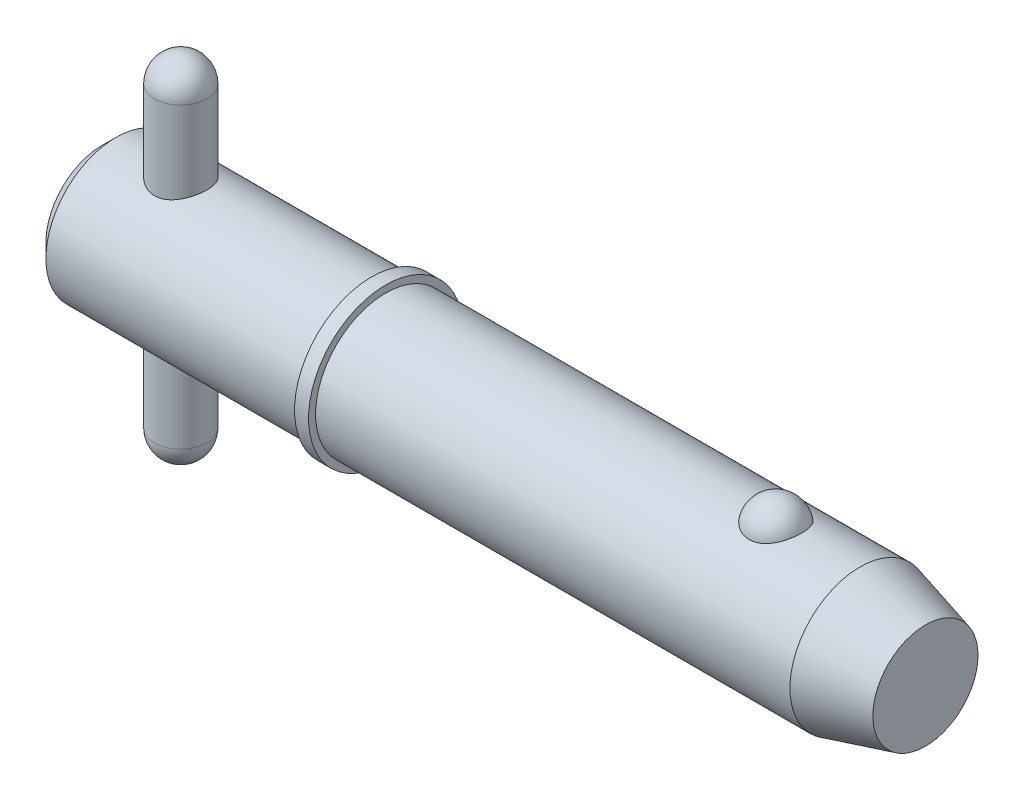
ISO-10303-21;
HEADER;
FILE_DESCRIPTION(('STEP AP214'),'2;1');
FILE_NAME('part.step','',(''),(''),'','','');
FILE_SCHEMA(('AUTOMOTIVE_DESIGN { 1 0 10303 214 1 1 1 1 }'));
ENDSEC;
DATA;
#1=APPLICATION_CONTEXT('core data for automotive mechanical design processes');
#2=APPLICATION_PROTOCOL_DEFINITION('international standard','automotive_design',2000,#1);
#3=PRODUCT_CONTEXT('',#1,'mechanical');
#4=PRODUCT('Part','Part','',(#3));
#5=PRODUCT_RELATED_PRODUCT_CATEGORY('part','',(#4));
#6=PRODUCT_DEFINITION_FORMATION('','',#4);
#7=PRODUCT_DEFINITION_CONTEXT('part definition',#1,'design');
#8=PRODUCT_DEFINITION('design','',#6,#7);
#9=PRODUCT_DEFINITION_SHAPE('','',#8);
#10=(LENGTH_UNIT() NAMED_UNIT(*) SI_UNIT(.MILLI.,.METRE.));
#11=(NAMED_UNIT(*) PLANE_ANGLE_UNIT() SI_UNIT($,.RADIAN.));
#12=(NAMED_UNIT(*) SI_UNIT($,.STERADIAN.) SOLID_ANGLE_UNIT());
#13=UNCERTAINTY_MEASURE_WITH_UNIT(LENGTH_MEASURE(1.E-05),#10,'distance_accuracy_value','');
#14=(GEOMETRIC_REPRESENTATION_CONTEXT(3) GLOBAL_UNCERTAINTY_ASSIGNED_CONTEXT((#13)) GLOBAL_UNIT_ASSIGNED_CONTEXT((#10,
#11,#12)) REPRESENTATION_CONTEXT('',''));
#15=CARTESIAN_POINT('',(0.,0.,0.));
#16=DIRECTION('',(0.,0.,1.));
#17=DIRECTION('',(1.,0.,0.));
#18=AXIS2_PLACEMENT_3D('',#15,#16,#17);
#19=CARTESIAN_POINT('',(7.14,15.875,0.));
#20=DIRECTION('',(0.,-1.,0.));
#21=DIRECTION('',(0.,0.,-1.));
#22=AXIS2_PLACEMENT_3D('',#19,#20,#21);
#23=CYLINDRICAL_SURFACE('',#22,2.38);
#24=CARTESIAN_POINT('',(7.14,-13.495,0.));
#25=DIRECTION('',(0.,-1.,0.));
#26=DIRECTION('',(0.,0.,-1.));
#27=AXIS2_PLACEMENT_3D('',#24,#25,#26);
#28=CIRCLE('',#27,2.38);
#29=CARTESIAN_POINT('',(7.14,-13.495,-2.38));
#30=VERTEX_POINT('',#29);
#31=EDGE_CURVE('P0_E10',#30,#30,#28,.F.);
#32=ORIENTED_EDGE('',*,*,#31,.T.);
#33=EDGE_LOOP('',(#32));
#34=FACE_BOUND('',#33,.T.);
#35=CARTESIAN_POINT('',(7.14,13.495,0.));
#36=DIRECTION('',(0.,-1.,0.));
#37=DIRECTION('',(0.,0.,-1.));
#38=AXIS2_PLACEMENT_3D('',#35,#36,#37);
#39=CIRCLE('',#38,2.38);
#40=CARTESIAN_POINT('',(7.14,13.495,-2.38));
#41=VERTEX_POINT('',#40);
#42=EDGE_CURVE('P0_E21',#41,#41,#39,.T.);
#43=ORIENTED_EDGE('',*,*,#42,.T.);
#44=EDGE_LOOP('',(#43));
#45=FACE_BOUND('',#44,.T.);
#46=ADVANCED_FACE('P0_F14',(#34,#45),#23,.T.);
#47=CARTESIAN_POINT('',(7.14,-13.495,0.));
#48=DIRECTION('',(0.,0.,1.));
#49=DIRECTION('',(1.,0.,0.));
#50=AXIS2_PLACEMENT_3D('',#47,#48,#49);
#51=SPHERICAL_SURFACE('',#50,2.38);
#52=CARTESIAN_POINT('',(7.14,-13.495,0.));
#53=DIRECTION('',(0.,-1.,0.));
#54=DIRECTION('',(0.,0.,-1.));
#55=AXIS2_PLACEMENT_3D('',#52,#53,#54);
#56=SPHERICAL_SURFACE('',#55,2.38);
#57=ORIENTED_EDGE('',*,*,#31,.F.);
#58=EDGE_LOOP('',(#57));
#59=FACE_BOUND('',#58,.T.);
#60=ADVANCED_FACE('P0_F29',(#59),#56,.T.);
#61=CARTESIAN_POINT('',(7.14,13.495,0.));
#62=DIRECTION('',(0.,0.,1.));
#63=DIRECTION('',(1.,0.,0.));
#64=AXIS2_PLACEMENT_3D('',#61,#62,#63);
#65=SPHERICAL_SURFACE('',#64,2.38);
#66=CARTESIAN_POINT('',(7.14,13.495,0.));
#67=DIRECTION('',(0.,-1.,0.));
#68=DIRECTION('',(0.,0.,-1.));
#69=AXIS2_PLACEMENT_3D('',#66,#67,#68);
#70=SPHERICAL_SURFACE('',#69,2.38);
#71=ORIENTED_EDGE('',*,*,#42,.F.);
#72=EDGE_LOOP('',(#71));
#73=FACE_BOUND('',#72,.T.);
#74=ADVANCED_FACE('P0_F16',(#73),#70,.T.);
#75=CLOSED_SHELL('',(#46,#60,#74));
#76=MANIFOLD_SOLID_BREP('P0_B1',#75);
#77=CARTESIAN_POINT('',(0.,0.,0.));
#78=DIRECTION('',(1.,0.,0.));
#79=DIRECTION('',(0.,0.,-1.));
#80=AXIS2_PLACEMENT_3D('',#77,#78,#79);
#81=CYLINDRICAL_SURFACE('',#80,6.35);
#82=CARTESIAN_POINT('',(68.6753693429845,0.,0.));
#83=DIRECTION('',(1.,0.,0.));
#84=DIRECTION('',(0.,0.,-1.));
#85=AXIS2_PLACEMENT_3D('',#82,#83,#84);
#86=CIRCLE('',#85,6.35);
#87=CARTESIAN_POINT('',(68.6753693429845,0.,-6.35));
#88=VERTEX_POINT('',#87);
#89=EDGE_CURVE('P1_E81',#88,#88,#86,.T.);
#90=ORIENTED_EDGE('',*,*,#89,.F.);
#91=EDGE_LOOP('',(#90));
#92=FACE_BOUND('',#91,.T.);
#93=CARTESIAN_POINT('',(25.7,0.,0.));
#94=DIRECTION('',(1.,0.,0.));
#95=DIRECTION('',(0.,0.,-1.));
#96=AXIS2_PLACEMENT_3D('',#93,#94,#95);
#97=CIRCLE('',#96,6.35);
#98=CARTESIAN_POINT('',(25.7,0.,-6.35));
#99=VERTEX_POINT('',#98);
#100=EDGE_CURVE('P1_E85',#99,#99,#97,.T.);
#101=ORIENTED_EDGE('',*,*,#100,.T.);
#102=EDGE_LOOP('',(#101));
#103=FACE_BOUND('',#102,.T.);
#104=CARTESIAN_POINT('',(61.0500214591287,5.87502187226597,2.40969251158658));
#105=CARTESIAN_POINT('',(60.9250305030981,5.87501645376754,2.40969773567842));
#106=CARTESIAN_POINT('',(60.8000806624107,5.87916061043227,2.39967292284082));
#107=CARTESIAN_POINT('',(60.5539091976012,5.89523112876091,2.35991730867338));
#108=CARTESIAN_POINT('',(60.4326863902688,5.90715499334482,2.33019283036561));
#109=CARTESIAN_POINT('',(60.1975170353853,5.93739567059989,2.25201402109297));
#110=CARTESIAN_POINT('',(60.0835602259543,5.95570321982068,2.2035868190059));
#111=CARTESIAN_POINT('',(59.86557352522,5.99672067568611,2.08937987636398));
#112=CARTESIAN_POINT('',(59.7615457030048,6.01943149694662,2.02359652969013));
#113=CARTESIAN_POINT('',(59.5629437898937,6.06760647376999,1.8742896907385));
#114=CARTESIAN_POINT('',(59.4687268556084,6.09313095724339,1.79031110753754));
#115=CARTESIAN_POINT('',(59.2952557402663,6.14375873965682,1.60800178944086));
#116=CARTESIAN_POINT('',(59.2160043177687,6.16886196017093,1.50966841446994));
#117=CARTESIAN_POINT('',(59.0708457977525,6.21724600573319,1.29645884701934));
#118=CARTESIAN_POINT('',(59.0056885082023,6.24039621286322,1.18104158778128));
#119=CARTESIAN_POINT('',(58.8947035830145,6.28117277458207,0.94035184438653));
#120=CARTESIAN_POINT('',(58.8488776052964,6.29879865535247,0.815078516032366));
#121=CARTESIAN_POINT('',(58.7770234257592,6.32692073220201,0.556494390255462));
#122=CARTESIAN_POINT('',(58.751249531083,6.33732517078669,0.423102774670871));
#123=CARTESIAN_POINT('',(58.7209885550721,6.34957673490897,0.153542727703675));
#124=CARTESIAN_POINT('',(58.7165009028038,6.35142408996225,0.0173743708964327));
#125=CARTESIAN_POINT('',(58.7288655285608,6.34638925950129,-0.253036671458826));
#126=CARTESIAN_POINT('',(58.7455949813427,6.33955731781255,-0.387285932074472));
#127=CARTESIAN_POINT('',(58.799843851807,6.31794129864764,-0.65085123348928));
#128=CARTESIAN_POINT('',(58.8373636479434,6.30315707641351,-0.780167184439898));
#129=CARTESIAN_POINT('',(58.932500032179,6.26711642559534,-1.03041949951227));
#130=CARTESIAN_POINT('',(58.990143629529,6.24585130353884,-1.1513443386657));
#131=CARTESIAN_POINT('',(59.1243522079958,6.19905619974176,-1.38129800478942));
#132=CARTESIAN_POINT('',(59.2009187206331,6.17352587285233,-1.49032586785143));
#133=CARTESIAN_POINT('',(59.3717538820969,6.12080227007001,-1.69393164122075));
#134=CARTESIAN_POINT('',(59.4661008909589,6.09360200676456,-1.78844209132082));
#135=CARTESIAN_POINT('',(59.6701196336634,6.0407043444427,-1.95970536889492));
#136=CARTESIAN_POINT('',(59.7797900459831,6.01500681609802,-2.03645972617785));
#137=CARTESIAN_POINT('',(60.0091876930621,5.96867714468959,-2.16845644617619));
#138=CARTESIAN_POINT('',(60.1286522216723,5.94794910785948,-2.22412062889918));
#139=CARTESIAN_POINT('',(60.3762188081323,5.91340580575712,-2.31440992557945));
#140=CARTESIAN_POINT('',(60.5043175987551,5.8995879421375,-2.34904294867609));
#141=CARTESIAN_POINT('',(60.758582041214,5.88111049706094,-2.39491590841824));
#142=CARTESIAN_POINT('',(60.8845207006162,5.876025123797,-2.40724512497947));
#143=CARTESIAN_POINT('',(61.1367867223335,5.87428980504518,-2.41147867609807));
#144=CARTESIAN_POINT('',(61.263114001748,5.87763817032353,-2.40338710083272));
#145=CARTESIAN_POINT('',(61.5084170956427,5.89212921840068,-2.36762715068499));
#146=CARTESIAN_POINT('',(61.6274992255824,5.90302431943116,-2.34058030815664));
#147=CARTESIAN_POINT('',(61.8592447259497,5.93113752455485,-2.26839066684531));
#148=CARTESIAN_POINT('',(61.9719075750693,5.94835614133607,-2.22324640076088));
#149=CARTESIAN_POINT('',(62.1904009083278,5.98773016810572,-2.11493806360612));
#150=CARTESIAN_POINT('',(62.296028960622,6.00998499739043,-2.05140269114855));
#151=CARTESIAN_POINT('',(62.4953006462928,6.05690144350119,-1.90842705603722));
#152=CARTESIAN_POINT('',(62.5889415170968,6.08156361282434,-1.82898313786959));
#153=CARTESIAN_POINT('',(62.7666754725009,6.13211715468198,-1.65182429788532));
#154=CARTESIAN_POINT('',(62.850055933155,6.15800825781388,-1.55339381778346));
#155=CARTESIAN_POINT('',(62.9997900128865,6.20712834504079,-1.34374214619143));
#156=CARTESIAN_POINT('',(63.0661405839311,6.23035685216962,-1.23251867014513));
#157=CARTESIAN_POINT('',(63.1823455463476,6.27251177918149,-0.99644720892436));
#158=CARTESIAN_POINT('',(63.2316072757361,6.29127762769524,-0.871278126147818));
#159=CARTESIAN_POINT('',(63.3096142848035,6.3215862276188,-0.613870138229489));
#160=CARTESIAN_POINT('',(63.3383593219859,6.33312889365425,-0.48163114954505));
#161=CARTESIAN_POINT('',(63.3747705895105,6.34782349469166,-0.213672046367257));
#162=CARTESIAN_POINT('',(63.3824134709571,6.35096613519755,-0.0779482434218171));
#163=CARTESIAN_POINT('',(63.3763951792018,6.34851322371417,0.19294395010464));
#164=CARTESIAN_POINT('',(63.3627343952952,6.3429178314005,0.328112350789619));
#165=CARTESIAN_POINT('',(63.3145036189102,6.32360512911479,0.593406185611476));
#166=CARTESIAN_POINT('',(63.2800313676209,6.30992579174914,0.723552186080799));
#167=CARTESIAN_POINT('',(63.1909539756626,6.27586325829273,0.975834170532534));
#168=CARTESIAN_POINT('',(63.1363476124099,6.25547965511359,1.09796966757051));
#169=CARTESIAN_POINT('',(63.0077587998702,6.20998183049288,1.33148921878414));
#170=CARTESIAN_POINT('',(62.9336742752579,6.18484288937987,1.44281227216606));
#171=CARTESIAN_POINT('',(62.7678204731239,6.13258735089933,1.65087683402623));
#172=CARTESIAN_POINT('',(62.6760515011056,6.10547078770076,1.74761859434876));
#173=CARTESIAN_POINT('',(62.4771839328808,6.05235879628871,1.92350926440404));
#174=CARTESIAN_POINT('',(62.370133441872,6.02636017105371,2.00271146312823));
#175=CARTESIAN_POINT('',(62.1431384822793,5.97843747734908,2.1415415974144));
#176=CARTESIAN_POINT('',(62.023191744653,5.95651412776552,2.20116608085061));
#177=CARTESIAN_POINT('',(61.7645236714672,5.91812106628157,2.30250570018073));
#178=CARTESIAN_POINT('',(61.6250698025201,5.90217533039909,2.34256795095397));
#179=CARTESIAN_POINT('',(61.3403974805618,5.88063128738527,2.39615214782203));
#180=CARTESIAN_POINT('',(61.1951817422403,5.87502816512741,2.4096864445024));
#181=CARTESIAN_POINT('',(61.0500214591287,5.87502187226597,2.40969251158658));
#182=B_SPLINE_CURVE_WITH_KNOTS('',3,(#104,#105,#106,#107,#108,#109,#110,#111,#112,#113,#114,
#115,#116,#117,#118,#119,#120,#121,#122,#123,#124,#125,#126,#127,#128,#129,#130,#131,#132,#133,
#134,#135,#136,#137,#138,#139,#140,#141,#142,#143,#144,#145,#146,#147,#148,#149,#150,#151,#152,
#153,#154,#155,#156,#157,#158,#159,#160,#161,#162,#163,#164,#165,#166,#167,#168,#169,#170,#171,
#172,#173,#174,#175,#176,#177,#178,#179,#180,#181),.UNSPECIFIED.,.T.,.F.,(4,2,2,2,2,2,2,2,2,2,2,
2,2,2,2,2,2,2,2,2,2,2,2,2,2,2,2,2,2,2,2,2,2,2,2,2,2,2,4),(0.,0.374440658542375,
0.748761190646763,1.12254078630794,1.49639810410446,1.8809887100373,2.2656501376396,
2.66741104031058,3.06920639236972,3.47601794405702,3.88281858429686,4.28727498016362,
4.69173873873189,5.09674745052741,5.50178895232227,5.90865911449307,6.31549420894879,
6.71369855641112,7.11175305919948,7.48978077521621,7.86773278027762,8.23383886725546,
8.59997464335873,8.97409044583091,9.34829231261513,9.74122667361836,10.1342313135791,
10.5397522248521,10.945277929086,11.3512521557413,11.7572189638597,12.1612938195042,
12.5653932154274,12.9716540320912,13.3779078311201,13.7829098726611,14.1879832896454,
14.6230486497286,15.0579114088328),.UNSPECIFIED.);
#183=CARTESIAN_POINT('',(61.0500214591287,5.87502187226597,2.40969251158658));
#184=VERTEX_POINT('',#183);
#185=EDGE_CURVE('P1_E35',#184,#184,#182,.T.);
#186=ORIENTED_EDGE('',*,*,#185,.T.);
#187=EDGE_LOOP('',(#186));
#188=FACE_BOUND('',#187,.T.);
#189=ADVANCED_FACE('P1_F13',(#92,#103,#188),#81,.T.);
#190=CARTESIAN_POINT('',(0.,0.,0.));
#191=DIRECTION('',(-1.,0.,0.));
#192=DIRECTION('',(0.,0.,1.));
#193=AXIS2_PLACEMENT_3D('',#190,#191,#192);
#194=PLANE('',#193);
#195=CARTESIAN_POINT('',(0.,0.,0.));
#196=DIRECTION('',(1.,0.,0.));
#197=DIRECTION('',(0.,0.,-1.));
#198=AXIS2_PLACEMENT_3D('',#195,#196,#197);
#199=CIRCLE('',#198,5.08);
#200=CARTESIAN_POINT('',(0.,0.,-5.08));
#201=VERTEX_POINT('',#200);
#202=EDGE_CURVE('P1_E9',#201,#201,#199,.T.);
#203=ORIENTED_EDGE('',*,*,#202,.F.);
#204=EDGE_LOOP('',(#203));
#205=FACE_BOUND('',#204,.T.);
#206=ADVANCED_FACE('P1_F15',(#205),#194,.T.);
#207=CARTESIAN_POINT('',(1.27,0.,0.));
#208=DIRECTION('',(1.,0.,0.));
#209=DIRECTION('',(0.,0.,-1.));
#210=AXIS2_PLACEMENT_3D('',#207,#208,#209);
#211=CONICAL_SURFACE('',#210,6.35,0.78539816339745);
#212=ORIENTED_EDGE('',*,*,#202,.T.);
#213=EDGE_LOOP('',(#212));
#214=FACE_BOUND('',#213,.T.);
#215=CARTESIAN_POINT('',(1.27,0.,0.));
#216=DIRECTION('',(1.,0.,0.));
#217=DIRECTION('',(0.,0.,-1.));
#218=AXIS2_PLACEMENT_3D('',#215,#216,#217);
#219=CIRCLE('',#218,6.35);
#220=CARTESIAN_POINT('',(1.27,0.,-6.35));
#221=VERTEX_POINT('',#220);
#222=EDGE_CURVE('P1_E26',#221,#221,#219,.T.);
#223=ORIENTED_EDGE('',*,*,#222,.F.);
#224=EDGE_LOOP('',(#223));
#225=FACE_BOUND('',#224,.T.);
#226=ADVANCED_FACE('P1_F77',(#214,#225),#211,.T.);
#227=CARTESIAN_POINT('',(0.,0.,0.));
#228=DIRECTION('',(1.,0.,0.));
#229=DIRECTION('',(0.,0.,-1.));
#230=AXIS2_PLACEMENT_3D('',#227,#228,#229);
#231=CYLINDRICAL_SURFACE('',#230,6.35);
#232=CARTESIAN_POINT('',(7.14,-5.88711304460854,2.38));
#233=CARTESIAN_POINT('',(7.01146258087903,-5.88710856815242,2.38000480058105));
#234=CARTESIAN_POINT('',(6.88295682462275,-5.89136840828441,2.36955244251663));
#235=CARTESIAN_POINT('',(6.62981934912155,-5.90782785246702,2.32820953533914));
#236=CARTESIAN_POINT('',(6.50518751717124,-5.92002722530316,2.29731958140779));
#237=CARTESIAN_POINT('',(6.26352403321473,-5.95079384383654,2.21639366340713));
#238=CARTESIAN_POINT('',(6.14647496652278,-5.96934583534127,2.16640353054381));
#239=CARTESIAN_POINT('',(5.92237941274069,-6.01070278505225,2.04885862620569));
#240=CARTESIAN_POINT('',(5.81533593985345,-6.03350901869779,1.98129858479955));
#241=CARTESIAN_POINT('',(5.60897525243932,-6.08207341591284,1.82693902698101));
#242=CARTESIAN_POINT('',(5.51022503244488,-6.10791836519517,1.73940861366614));
#243=CARTESIAN_POINT('',(5.32840561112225,-6.15892405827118,1.54914379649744));
#244=CARTESIAN_POINT('',(5.24533975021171,-6.1840846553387,1.44640616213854));
#245=CARTESIAN_POINT('',(5.09451639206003,-6.23191821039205,1.22434014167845));
#246=CARTESIAN_POINT('',(5.02737511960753,-6.25447755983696,1.10456656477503));
#247=CARTESIAN_POINT('',(4.91443001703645,-6.2935236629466,0.854429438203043));
#248=CARTESIAN_POINT('',(4.86861879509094,-6.31001251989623,0.724069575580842));
#249=CARTESIAN_POINT('',(4.80162253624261,-6.33444370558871,0.46242122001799));
#250=CARTESIAN_POINT('',(4.77946137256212,-6.34272370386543,0.331414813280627));
#251=CARTESIAN_POINT('',(4.75726677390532,-6.35101600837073,0.0672982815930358));
#252=CARTESIAN_POINT('',(4.75722615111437,-6.35103100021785,-0.0658111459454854));
#253=CARTESIAN_POINT('',(4.77870510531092,-6.3430064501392,-0.323358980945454));
#254=CARTESIAN_POINT('',(4.79915922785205,-6.33536494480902,-0.447900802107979));
#255=CARTESIAN_POINT('',(4.85925493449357,-6.31340794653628,-0.69163609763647));
#256=CARTESIAN_POINT('',(4.89889787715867,-6.29909198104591,-0.810829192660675));
#257=CARTESIAN_POINT('',(4.9967414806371,-6.26494471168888,-1.04254212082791));
#258=CARTESIAN_POINT('',(5.05520370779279,-6.24503620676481,-1.1549396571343));
#259=CARTESIAN_POINT('',(5.1887948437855,-6.20171869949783,-1.3686079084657));
#260=CARTESIAN_POINT('',(5.26392912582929,-6.17830856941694,-1.46987502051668));
#261=CARTESIAN_POINT('',(5.43386591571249,-6.12878580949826,-1.66468415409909));
#262=CARTESIAN_POINT('',(5.52956139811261,-6.10259519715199,-1.75742857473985));
#263=CARTESIAN_POINT('',(5.73530435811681,-6.05155777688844,-1.92585331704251));
#264=CARTESIAN_POINT('',(5.84535542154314,-6.02671130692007,-2.00152936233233));
#265=CARTESIAN_POINT('',(6.07982989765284,-5.98068420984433,-2.13519109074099));
#266=CARTESIAN_POINT('',(6.20451768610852,-5.95959698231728,-2.19274775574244));
#267=CARTESIAN_POINT('',(6.4628145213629,-5.92455622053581,-2.28574558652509));
#268=CARTESIAN_POINT('',(6.59641856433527,-5.91059872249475,-2.32119904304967));
#269=CARTESIAN_POINT('',(6.86087441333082,-5.8923327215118,-2.36717069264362));
#270=CARTESIAN_POINT('',(6.99147192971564,-5.8875347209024,-2.37895573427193));
#271=CARTESIAN_POINT('',(7.25283805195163,-5.88674545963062,-2.38091046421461));
#272=CARTESIAN_POINT('',(7.38360660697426,-5.89075200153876,-2.37108554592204));
#273=CARTESIAN_POINT('',(7.63510696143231,-5.90662331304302,-2.33124781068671));
#274=CARTESIAN_POINT('',(7.75602069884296,-5.91810660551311,-2.30221396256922));
#275=CARTESIAN_POINT('',(7.99120505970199,-5.94718527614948,-2.22601401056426));
#276=CARTESIAN_POINT('',(8.10547431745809,-5.96478190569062,-2.17884419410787));
#277=CARTESIAN_POINT('',(8.32888632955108,-6.00491533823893,-2.06572311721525));
#278=CARTESIAN_POINT('',(8.43767672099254,-6.02761250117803,-1.99913452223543));
#279=CARTESIAN_POINT('',(8.6429894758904,-6.07511988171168,-1.84974438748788));
#280=CARTESIAN_POINT('',(8.73950733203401,-6.09993087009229,-1.76693691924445));
#281=CARTESIAN_POINT('',(8.9238741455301,-6.1507686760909,-1.58125563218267));
#282=CARTESIAN_POINT('',(9.01078732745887,-6.17677301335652,-1.47744327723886));
#283=CARTESIAN_POINT('',(9.16607127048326,-6.22556172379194,-1.25606967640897));
#284=CARTESIAN_POINT('',(9.23444197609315,-6.24834608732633,-1.13850838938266));
#285=CARTESIAN_POINT('',(9.3502493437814,-6.28811144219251,-0.893050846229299));
#286=CARTESIAN_POINT('',(9.39775808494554,-6.30511236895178,-0.765192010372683));
#287=CARTESIAN_POINT('',(9.47032640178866,-6.33145833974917,-0.502514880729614));
#288=CARTESIAN_POINT('',(9.49539651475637,-6.34080697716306,-0.367699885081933));
#289=CARTESIAN_POINT('',(9.52124059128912,-6.35045496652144,-0.103396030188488));
#290=CARTESIAN_POINT('',(9.52334421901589,-6.35124952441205,0.025945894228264));
#291=CARTESIAN_POINT('',(9.50661518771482,-6.34499064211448,0.283061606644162));
#292=CARTESIAN_POINT('',(9.48778504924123,-6.33793814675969,0.410835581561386));
#293=CARTESIAN_POINT('',(9.43065630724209,-6.31700307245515,0.658028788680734));
#294=CARTESIAN_POINT('',(9.39284291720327,-6.30329098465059,0.7775756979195));
#295=CARTESIAN_POINT('',(9.29930406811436,-6.27046903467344,1.00863789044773));
#296=CARTESIAN_POINT('',(9.2435752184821,-6.25135815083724,1.12015164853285));
#297=CARTESIAN_POINT('',(9.11312349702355,-6.20865254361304,1.33711407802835));
#298=CARTESIAN_POINT('',(9.03770094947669,-6.18490316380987,1.44211105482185));
#299=CARTESIAN_POINT('',(8.87110640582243,-6.13583718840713,1.63836897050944));
#300=CARTESIAN_POINT('',(8.77992879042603,-6.11052003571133,1.72962498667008));
#301=CARTESIAN_POINT('',(8.57869799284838,-6.05953829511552,1.90076098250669));
#302=CARTESIAN_POINT('',(8.46790320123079,-6.03392573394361,1.97978778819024));
#303=CARTESIAN_POINT('',(8.23379693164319,-5.98676607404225,2.11813466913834));
#304=CARTESIAN_POINT('',(8.11048418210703,-5.9652193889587,2.17745273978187));
#305=CARTESIAN_POINT('',(7.84900037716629,-5.92818393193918,2.27641807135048));
#306=CARTESIAN_POINT('',(7.71041678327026,-5.91299857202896,2.31510015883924));
#307=CARTESIAN_POINT('',(7.42787316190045,-5.89246887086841,2.36688002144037));
#308=CARTESIAN_POINT('',(7.28391673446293,-5.88711805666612,2.37999462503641));
#309=CARTESIAN_POINT('',(7.14,-5.88711304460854,2.38));
#310=B_SPLINE_CURVE_WITH_KNOTS('',3,(#232,#233,#234,#235,#236,#237,#238,#239,#240,#241,#242,
#243,#244,#245,#246,#247,#248,#249,#250,#251,#252,#253,#254,#255,#256,#257,#258,#259,#260,#261,
#262,#263,#264,#265,#266,#267,#268,#269,#270,#271,#272,#273,#274,#275,#276,#277,#278,#279,#280,
#281,#282,#283,#284,#285,#286,#287,#288,#289,#290,#291,#292,#293,#294,#295,#296,#297,#298,#299,
#300,#301,#302,#303,#304,#305,#306,#307,#308,#309),.UNSPECIFIED.,.T.,.F.,(4,2,2,2,2,2,2,2,2,2,2,
2,2,2,2,2,2,2,2,2,2,2,2,2,2,2,2,2,2,2,2,2,2,2,2,2,2,2,4),(0.,0.385076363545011,
0.770141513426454,1.15428843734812,1.53855071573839,1.94016118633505,2.3418570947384,
2.75720522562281,3.1724093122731,3.569721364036,3.96690431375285,4.34445758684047,
4.72203759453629,5.10511017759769,5.48830640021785,5.89390240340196,6.29959991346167,
6.71428455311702,7.12873839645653,7.52034494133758,7.91185376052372,8.28480528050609,
8.65783318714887,9.0448340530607,9.43197664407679,9.84363087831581,10.2552863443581,
10.6655081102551,11.0755371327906,11.4616919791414,11.847800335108,12.224507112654,
12.6012852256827,12.9938941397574,13.386643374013,13.8000944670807,14.2135876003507,
14.6450218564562,15.0761720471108),.UNSPECIFIED.);
#311=CARTESIAN_POINT('',(7.14,-5.88711304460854,2.38));
#312=VERTEX_POINT('',#311);
#313=EDGE_CURVE('P1_E17',#312,#312,#310,.T.);
#314=ORIENTED_EDGE('',*,*,#313,.F.);
#315=EDGE_LOOP('',(#314));
#316=FACE_BOUND('',#315,.T.);
#317=CARTESIAN_POINT('',(7.14,5.88711304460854,2.38));
#318=CARTESIAN_POINT('',(7.26853741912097,5.88710856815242,2.38000480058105));
#319=CARTESIAN_POINT('',(7.39704317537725,5.89136840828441,2.36955244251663));
#320=CARTESIAN_POINT('',(7.65018065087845,5.90782785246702,2.32820953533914));
#321=CARTESIAN_POINT('',(7.77481248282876,5.92002722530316,2.29731958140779));
#322=CARTESIAN_POINT('',(8.01647596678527,5.95079384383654,2.21639366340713));
#323=CARTESIAN_POINT('',(8.13352503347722,5.96934583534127,2.16640353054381));
#324=CARTESIAN_POINT('',(8.35762058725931,6.01070278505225,2.04885862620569));
#325=CARTESIAN_POINT('',(8.46466406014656,6.03350901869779,1.98129858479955));
#326=CARTESIAN_POINT('',(8.67102474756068,6.08207341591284,1.82693902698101));
#327=CARTESIAN_POINT('',(8.76977496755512,6.10791836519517,1.73940861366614));
#328=CARTESIAN_POINT('',(8.95159438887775,6.15892405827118,1.54914379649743));
#329=CARTESIAN_POINT('',(9.03466024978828,6.1840846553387,1.44640616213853));
#330=CARTESIAN_POINT('',(9.18548360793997,6.23191821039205,1.22434014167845));
#331=CARTESIAN_POINT('',(9.25262488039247,6.25447755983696,1.10456656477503));
#332=CARTESIAN_POINT('',(9.36556998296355,6.2935236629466,0.854429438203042));
#333=CARTESIAN_POINT('',(9.41138120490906,6.31001251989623,0.72406957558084));
#334=CARTESIAN_POINT('',(9.47837746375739,6.33444370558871,0.462421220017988));
#335=CARTESIAN_POINT('',(9.50053862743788,6.34272370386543,0.331414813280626));
#336=CARTESIAN_POINT('',(9.52273322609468,6.35101600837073,0.0672982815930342));
#337=CARTESIAN_POINT('',(9.52277384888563,6.35103100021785,-0.0658111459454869));
#338=CARTESIAN_POINT('',(9.50129489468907,6.3430064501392,-0.323358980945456));
#339=CARTESIAN_POINT('',(9.48084077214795,6.33536494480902,-0.447900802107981));
#340=CARTESIAN_POINT('',(9.42074506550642,6.31340794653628,-0.691636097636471));
#341=CARTESIAN_POINT('',(9.38110212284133,6.29909198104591,-0.810829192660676));
#342=CARTESIAN_POINT('',(9.2832585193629,6.26494471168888,-1.04254212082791));
#343=CARTESIAN_POINT('',(9.22479629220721,6.24503620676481,-1.1549396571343));
#344=CARTESIAN_POINT('',(9.0912051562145,6.20171869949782,-1.3686079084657));
#345=CARTESIAN_POINT('',(9.0160708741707,6.17830856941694,-1.46987502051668));
#346=CARTESIAN_POINT('',(8.84613408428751,6.12878580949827,-1.66468415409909));
#347=CARTESIAN_POINT('',(8.75043860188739,6.10259519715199,-1.75742857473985));
#348=CARTESIAN_POINT('',(8.54469564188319,6.05155777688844,-1.92585331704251));
#349=CARTESIAN_POINT('',(8.43464457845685,6.02671130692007,-2.00152936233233));
#350=CARTESIAN_POINT('',(8.20017010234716,5.98068420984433,-2.13519109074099));
#351=CARTESIAN_POINT('',(8.07548231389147,5.95959698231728,-2.19274775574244));
#352=CARTESIAN_POINT('',(7.8171854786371,5.9245562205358,-2.28574558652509));
#353=CARTESIAN_POINT('',(7.68358143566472,5.91059872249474,-2.32119904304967));
#354=CARTESIAN_POINT('',(7.41912558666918,5.8923327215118,-2.36717069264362));
#355=CARTESIAN_POINT('',(7.28852807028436,5.8875347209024,-2.37895573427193));
#356=CARTESIAN_POINT('',(7.02716194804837,5.88674545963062,-2.38091046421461));
#357=CARTESIAN_POINT('',(6.89639339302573,5.89075200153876,-2.37108554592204));
#358=CARTESIAN_POINT('',(6.64489303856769,5.90662331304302,-2.33124781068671));
#359=CARTESIAN_POINT('',(6.52397930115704,5.91810660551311,-2.30221396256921));
#360=CARTESIAN_POINT('',(6.288794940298,5.94718527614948,-2.22601401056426));
#361=CARTESIAN_POINT('',(6.17452568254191,5.96478190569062,-2.17884419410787));
#362=CARTESIAN_POINT('',(5.95111367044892,6.00491533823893,-2.06572311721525));
#363=CARTESIAN_POINT('',(5.84232327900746,6.02761250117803,-1.99913452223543));
#364=CARTESIAN_POINT('',(5.6370105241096,6.07511988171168,-1.84974438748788));
#365=CARTESIAN_POINT('',(5.54049266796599,6.09993087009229,-1.76693691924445));
#366=CARTESIAN_POINT('',(5.3561258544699,6.1507686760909,-1.58125563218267));
#367=CARTESIAN_POINT('',(5.26921267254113,6.17677301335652,-1.47744327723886));
#368=CARTESIAN_POINT('',(5.11392872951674,6.22556172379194,-1.25606967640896));
#369=CARTESIAN_POINT('',(5.04555802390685,6.24834608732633,-1.13850838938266));
#370=CARTESIAN_POINT('',(4.9297506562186,6.28811144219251,-0.893050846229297));
#371=CARTESIAN_POINT('',(4.88224191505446,6.30511236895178,-0.76519201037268));
#372=CARTESIAN_POINT('',(4.80967359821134,6.33145833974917,-0.502514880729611));
#373=CARTESIAN_POINT('',(4.78460348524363,6.34080697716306,-0.36769988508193));
#374=CARTESIAN_POINT('',(4.75875940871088,6.35045496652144,-0.103396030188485));
#375=CARTESIAN_POINT('',(4.75665578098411,6.35124952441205,0.025945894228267));
#376=CARTESIAN_POINT('',(4.77338481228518,6.34499064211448,0.283061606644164));
#377=CARTESIAN_POINT('',(4.79221495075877,6.33793814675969,0.410835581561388));
#378=CARTESIAN_POINT('',(4.84934369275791,6.31700307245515,0.658028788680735));
#379=CARTESIAN_POINT('',(4.88715708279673,6.30329098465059,0.777575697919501));
#380=CARTESIAN_POINT('',(4.98069593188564,6.27046903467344,1.00863789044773));
#381=CARTESIAN_POINT('',(5.0364247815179,6.25135815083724,1.12015164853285));
#382=CARTESIAN_POINT('',(5.16687650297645,6.20865254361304,1.33711407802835));
#383=CARTESIAN_POINT('',(5.24229905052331,6.18490316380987,1.44211105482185));
#384=CARTESIAN_POINT('',(5.40889359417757,6.13583718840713,1.63836897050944));
#385=CARTESIAN_POINT('',(5.50007120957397,6.11052003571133,1.72962498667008));
#386=CARTESIAN_POINT('',(5.70130200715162,6.05953829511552,1.90076098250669));
#387=CARTESIAN_POINT('',(5.81209679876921,6.03392573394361,1.97978778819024));
#388=CARTESIAN_POINT('',(6.04620306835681,5.98676607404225,2.11813466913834));
#389=CARTESIAN_POINT('',(6.16951581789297,5.9652193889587,2.17745273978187));
#390=CARTESIAN_POINT('',(6.43099962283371,5.92818393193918,2.27641807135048));
#391=CARTESIAN_POINT('',(6.56958321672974,5.91299857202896,2.31510015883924));
#392=CARTESIAN_POINT('',(6.85212683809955,5.89246887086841,2.36688002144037));
#393=CARTESIAN_POINT('',(6.99608326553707,5.88711805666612,2.37999462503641));
#394=CARTESIAN_POINT('',(7.14,5.88711304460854,2.38));
#395=B_SPLINE_CURVE_WITH_KNOTS('',3,(#317,#318,#319,#320,#321,#322,#323,#324,#325,#326,#327,
#328,#329,#330,#331,#332,#333,#334,#335,#336,#337,#338,#339,#340,#341,#342,#343,#344,#345,#346,
#347,#348,#349,#350,#351,#352,#353,#354,#355,#356,#357,#358,#359,#360,#361,#362,#363,#364,#365,
#366,#367,#368,#369,#370,#371,#372,#373,#374,#375,#376,#377,#378,#379,#380,#381,#382,#383,#384,
#385,#386,#387,#388,#389,#390,#391,#392,#393,#394),.UNSPECIFIED.,.T.,.F.,(4,2,2,2,2,2,2,2,2,2,2,
2,2,2,2,2,2,2,2,2,2,2,2,2,2,2,2,2,2,2,2,2,2,2,2,2,2,2,4),(0.,0.385076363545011,
0.770141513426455,1.15428843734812,1.53855071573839,1.94016118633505,2.3418570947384,
2.75720522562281,3.1724093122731,3.56972136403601,3.96690431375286,4.34445758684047,
4.72203759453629,5.10511017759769,5.48830640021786,5.89390240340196,6.29959991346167,
6.71428455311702,7.12873839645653,7.52034494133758,7.91185376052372,8.2848052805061,
8.65783318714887,9.0448340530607,9.43197664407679,9.84363087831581,10.2552863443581,
10.6655081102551,11.0755371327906,11.4616919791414,11.847800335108,12.2245071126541,
12.6012852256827,12.9938941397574,13.386643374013,13.8000944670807,14.2135876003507,
14.6450218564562,15.0761720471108),.UNSPECIFIED.);
#396=CARTESIAN_POINT('',(7.14,5.88711304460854,2.38));
#397=VERTEX_POINT('',#396);
#398=EDGE_CURVE('P1_E43',#397,#397,#395,.T.);
#399=ORIENTED_EDGE('',*,*,#398,.F.);
#400=EDGE_LOOP('',(#399));
#401=FACE_BOUND('',#400,.T.);
#402=ORIENTED_EDGE('',*,*,#222,.T.);
#403=EDGE_LOOP('',(#402));
#404=FACE_BOUND('',#403,.T.);
#405=CARTESIAN_POINT('',(24.43,0.,0.));
#406=DIRECTION('',(1.,0.,0.));
#407=DIRECTION('',(0.,0.,-1.));
#408=AXIS2_PLACEMENT_3D('',#405,#406,#407);
#409=CIRCLE('',#408,6.35);
#410=CARTESIAN_POINT('',(24.43,0.,-6.35));
#411=VERTEX_POINT('',#410);
#412=EDGE_CURVE('P1_E31',#411,#411,#409,.T.);
#413=ORIENTED_EDGE('',*,*,#412,.F.);
#414=EDGE_LOOP('',(#413));
#415=FACE_BOUND('',#414,.T.);
#416=ADVANCED_FACE('P1_F103',(#316,#401,#404,#415),#231,.T.);
#417=CARTESIAN_POINT('',(24.43,6.35,0.));
#418=DIRECTION('',(-1.,0.,0.));
#419=DIRECTION('',(0.,0.,1.));
#420=AXIS2_PLACEMENT_3D('',#417,#418,#419);
#421=PLANE('',#420);
#422=ORIENTED_EDGE('',*,*,#412,.T.);
#423=EDGE_LOOP('',(#422));
#424=FACE_BOUND('',#423,.T.);
#425=CARTESIAN_POINT('',(24.43,0.,0.));
#426=DIRECTION('',(1.,0.,0.));
#427=DIRECTION('',(0.,0.,-1.));
#428=AXIS2_PLACEMENT_3D('',#425,#426,#427);
#429=CIRCLE('',#428,6.985);
#430=CARTESIAN_POINT('',(24.43,0.,-6.985));
#431=VERTEX_POINT('',#430);
#432=EDGE_CURVE('P1_E91',#431,#431,#429,.T.);
#433=ORIENTED_EDGE('',*,*,#432,.F.);
#434=EDGE_LOOP('',(#433));
#435=FACE_BOUND('',#434,.T.);
#436=ADVANCED_FACE('P1_F100',(#424,#435),#421,.T.);
#437=CARTESIAN_POINT('',(0.,0.,0.));
#438=DIRECTION('',(1.,0.,0.));
#439=DIRECTION('',(0.,0.,-1.));
#440=AXIS2_PLACEMENT_3D('',#437,#438,#439);
#441=CYLINDRICAL_SURFACE('',#440,6.985);
#442=ORIENTED_EDGE('',*,*,#432,.T.);
#443=EDGE_LOOP('',(#442));
#444=FACE_BOUND('',#443,.T.);
#445=CARTESIAN_POINT('',(25.7,0.,0.));
#446=DIRECTION('',(1.,0.,0.));
#447=DIRECTION('',(0.,0.,-1.));
#448=AXIS2_PLACEMENT_3D('',#445,#446,#447);
#449=CIRCLE('',#448,6.985);
#450=CARTESIAN_POINT('',(25.7,0.,-6.985));
#451=VERTEX_POINT('',#450);
#452=EDGE_CURVE('P1_E88',#451,#451,#449,.T.);
#453=ORIENTED_EDGE('',*,*,#452,.F.);
#454=EDGE_LOOP('',(#453));
#455=FACE_BOUND('',#454,.T.);
#456=ADVANCED_FACE('P1_F68',(#444,#455),#441,.T.);
#457=CARTESIAN_POINT('',(25.7,6.985,0.));
#458=DIRECTION('',(1.,0.,0.));
#459=DIRECTION('',(0.,0.,-1.));
#460=AXIS2_PLACEMENT_3D('',#457,#458,#459);
#461=PLANE('',#460);
#462=ORIENTED_EDGE('',*,*,#452,.T.);
#463=EDGE_LOOP('',(#462));
#464=FACE_BOUND('',#463,.T.);
#465=ORIENTED_EDGE('',*,*,#100,.F.);
#466=EDGE_LOOP('',(#465));
#467=FACE_BOUND('',#466,.T.);
#468=ADVANCED_FACE('P1_F62',(#464,#467),#461,.T.);
#469=CARTESIAN_POINT('',(74.6,0.,0.));
#470=DIRECTION('',(-1.,0.,0.));
#471=DIRECTION('',(0.,0.,1.));
#472=AXIS2_PLACEMENT_3D('',#469,#470,#471);
#473=CONICAL_SURFACE('',#472,4.76250000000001,0.26179938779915);
#474=ORIENTED_EDGE('',*,*,#89,.T.);
#475=EDGE_LOOP('',(#474));
#476=FACE_BOUND('',#475,.T.);
#477=CARTESIAN_POINT('',(74.6,0.,0.));
#478=DIRECTION('',(1.,0.,0.));
#479=DIRECTION('',(0.,0.,-1.));
#480=AXIS2_PLACEMENT_3D('',#477,#478,#479);
#481=CIRCLE('',#480,4.76250000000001);
#482=CARTESIAN_POINT('',(74.6,0.,-4.76250000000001));
#483=VERTEX_POINT('',#482);
#484=EDGE_CURVE('P1_E42',#483,#483,#481,.T.);
#485=ORIENTED_EDGE('',*,*,#484,.F.);
#486=EDGE_LOOP('',(#485));
#487=FACE_BOUND('',#486,.T.);
#488=ADVANCED_FACE('P1_F59',(#476,#487),#473,.T.);
#489=CARTESIAN_POINT('',(74.6,4.76250000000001,0.));
#490=DIRECTION('',(1.,0.,0.));
#491=DIRECTION('',(0.,0.,-1.));
#492=AXIS2_PLACEMENT_3D('',#489,#490,#491);
#493=PLANE('',#492);
#494=ORIENTED_EDGE('',*,*,#484,.T.);
#495=EDGE_LOOP('',(#494));
#496=FACE_BOUND('',#495,.T.);
#497=ADVANCED_FACE('P1_F55',(#496),#493,.T.);
#498=CARTESIAN_POINT('',(61.0500214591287,5.715,0.));
#499=DIRECTION('',(-1.,0.,0.));
#500=DIRECTION('',(0.,1.,0.));
#501=AXIS2_PLACEMENT_3D('',#498,#499,#500);
#502=SPHERICAL_SURFACE('',#501,2.41499999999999);
#503=ORIENTED_EDGE('',*,*,#185,.F.);
#504=EDGE_LOOP('',(#503));
#505=FACE_BOUND('',#504,.T.);
#506=ADVANCED_FACE('P1_F50',(#505),#502,.T.);
#507=CARTESIAN_POINT('',(7.14,-6.985,0.));
#508=DIRECTION('',(0.,1.,0.));
#509=DIRECTION('',(0.,0.,1.));
#510=AXIS2_PLACEMENT_3D('',#507,#508,#509);
#511=CYLINDRICAL_SURFACE('',#510,2.38);
#512=ORIENTED_EDGE('',*,*,#313,.T.);
#513=EDGE_LOOP('',(#512));
#514=FACE_BOUND('',#513,.T.);
#515=ORIENTED_EDGE('',*,*,#398,.T.);
#516=EDGE_LOOP('',(#515));
#517=FACE_BOUND('',#516,.T.);
#518=ADVANCED_FACE('P1_F54',(#514,#517),#511,.F.);
#519=CLOSED_SHELL('',(#189,#206,#226,#416,#436,#456,#468,#488,#497,#506,#518));
#520=MANIFOLD_SOLID_BREP('P1_B1',#519);
#521=ADVANCED_BREP_SHAPE_REPRESENTATION('',(#18,#76,#520),#14);
#522=SHAPE_DEFINITION_REPRESENTATION(#9,#521);
ENDSEC;
END-ISO-10303-21;
